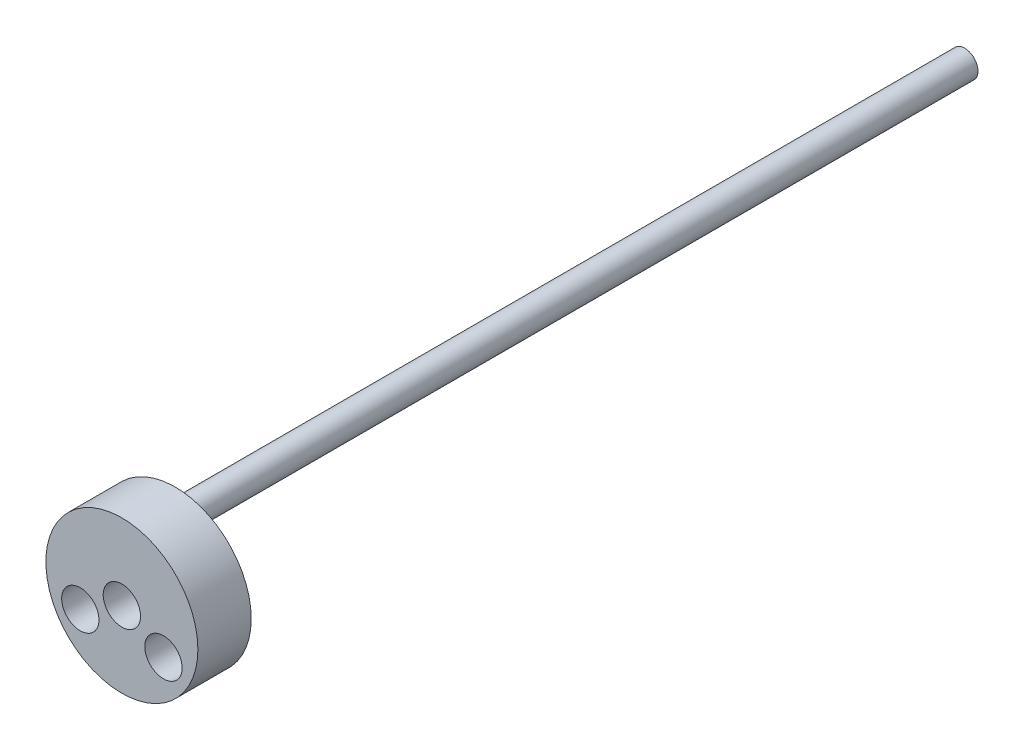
from build123d import *

# Parameters (mm, degrees)
ESQUISSE1_R      = 14.25
ESQUISSE1_R_2    = 3.5
EXTRUSION1_DEPTH = 10
EXTRUSION2_START = -8
ESQUISSE2_R      = 3.5
EXTRUSION2_DEPTH = 8
ESQUISSE3_R      = 2.5
EXTRUSION3_DEPTH = 150


with BuildPart() as part:
    # Esquisse1 → Extrusion1 (new body)
    with BuildSketch(Plane.XY):
        Circle(ESQUISSE1_R)
        with Locations((0, 9)):
            Circle(ESQUISSE1_R_2, mode=Mode.SUBTRACT)
        with Locations((7.794228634, -4.5)):
            Circle(ESQUISSE1_R_2, mode=Mode.SUBTRACT)
        with Locations((-7.794228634, -4.5)):
            Circle(ESQUISSE1_R_2, mode=Mode.SUBTRACT)
        Circle(ESQUISSE1_R_2, mode=Mode.SUBTRACT)
    extrude(amount=EXTRUSION1_DEPTH)

    # Esquisse2 → Extrusion2 (add)
    with BuildSketch(Plane.XY.offset(10).offset(EXTRUSION2_START)):
        with Locations((0, 9)):
            Circle(ESQUISSE2_R)
    extrude(amount=EXTRUSION2_DEPTH)

    # Esquisse3 → Extrusion3 (add)
    with BuildSketch(Plane(origin=(0, 0, 2), x_dir=(-1, 0, 0), z_dir=(0, 0, -1))):
        with Locations(Location((0, 9, 0), (0, 0, 180))):
            Circle(ESQUISSE3_R)
    extrude(amount=EXTRUSION3_DEPTH)


solid = part.part
